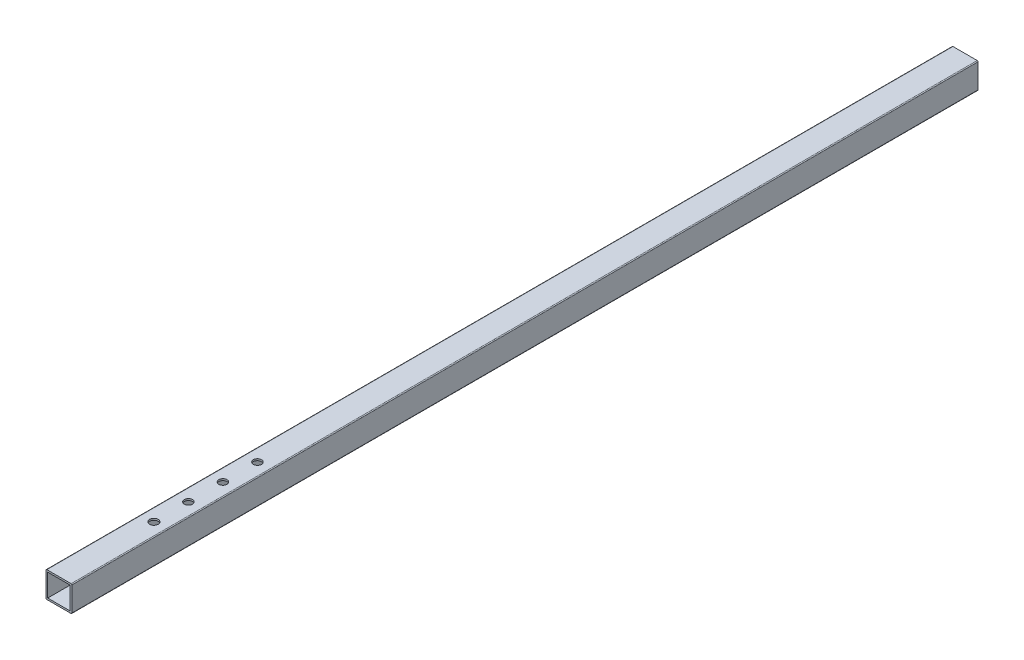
ISO-10303-21;
HEADER;
FILE_DESCRIPTION(('STEP AP214'),'2;1');
FILE_NAME('part.step','',(''),(''),'','','');
FILE_SCHEMA(('AUTOMOTIVE_DESIGN { 1 0 10303 214 1 1 1 1 }'));
ENDSEC;
DATA;
#1=APPLICATION_CONTEXT('core data for automotive mechanical design processes');
#2=APPLICATION_PROTOCOL_DEFINITION('international standard','automotive_design',2000,#1);
#3=PRODUCT_CONTEXT('',#1,'mechanical');
#4=PRODUCT('Part','Part','',(#3));
#5=PRODUCT_RELATED_PRODUCT_CATEGORY('part','',(#4));
#6=PRODUCT_DEFINITION_FORMATION('','',#4);
#7=PRODUCT_DEFINITION_CONTEXT('part definition',#1,'design');
#8=PRODUCT_DEFINITION('design','',#6,#7);
#9=PRODUCT_DEFINITION_SHAPE('','',#8);
#10=(LENGTH_UNIT() NAMED_UNIT(*) SI_UNIT(.MILLI.,.METRE.));
#11=(NAMED_UNIT(*) PLANE_ANGLE_UNIT() SI_UNIT($,.RADIAN.));
#12=(NAMED_UNIT(*) SI_UNIT($,.STERADIAN.) SOLID_ANGLE_UNIT());
#13=UNCERTAINTY_MEASURE_WITH_UNIT(LENGTH_MEASURE(1.E-05),#10,'distance_accuracy_value','');
#14=(GEOMETRIC_REPRESENTATION_CONTEXT(3) GLOBAL_UNCERTAINTY_ASSIGNED_CONTEXT((#13)) GLOBAL_UNIT_ASSIGNED_CONTEXT((#10,
#11,#12)) REPRESENTATION_CONTEXT('',''));
#15=CARTESIAN_POINT('',(0.,0.,0.));
#16=DIRECTION('',(0.,0.,1.));
#17=DIRECTION('',(1.,0.,0.));
#18=AXIS2_PLACEMENT_3D('',#15,#16,#17);
#19=CARTESIAN_POINT('',(-14.,15.,1050.));
#20=DIRECTION('',(0.,1.,0.));
#21=DIRECTION('',(0.,0.,1.));
#22=AXIS2_PLACEMENT_3D('',#19,#20,#21);
#23=PLANE('',#22);
#24=CARTESIAN_POINT('',(0.,15.,860.));
#25=DIRECTION('',(0.,-1.,0.));
#26=DIRECTION('',(0.,0.,-1.));
#27=AXIS2_PLACEMENT_3D('',#24,#25,#26);
#28=CIRCLE('',#27,4.74999999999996);
#29=CARTESIAN_POINT('',(0.,15.,855.25));
#30=VERTEX_POINT('',#29);
#31=EDGE_CURVE('E230',#30,#30,#28,.T.);
#32=ORIENTED_EDGE('',*,*,#31,.T.);
#33=EDGE_LOOP('',(#32));
#34=FACE_BOUND('',#33,.T.);
#35=CARTESIAN_POINT('',(0.,15.,940.));
#36=DIRECTION('',(0.,1.,0.));
#37=DIRECTION('',(0.,0.,1.));
#38=AXIS2_PLACEMENT_3D('',#35,#36,#37);
#39=CIRCLE('',#38,5.00000000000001);
#40=CARTESIAN_POINT('',(0.,15.,945.));
#41=VERTEX_POINT('',#40);
#42=EDGE_CURVE('E245',#41,#41,#39,.T.);
#43=ORIENTED_EDGE('',*,*,#42,.F.);
#44=EDGE_LOOP('',(#43));
#45=FACE_BOUND('',#44,.T.);
#46=CARTESIAN_POINT('',(0.,15.,820.));
#47=DIRECTION('',(0.,1.,0.));
#48=DIRECTION('',(0.,0.,1.));
#49=AXIS2_PLACEMENT_3D('',#46,#47,#48);
#50=CIRCLE('',#49,4.74999999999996);
#51=CARTESIAN_POINT('',(0.,15.,824.75));
#52=VERTEX_POINT('',#51);
#53=EDGE_CURVE('E142',#52,#52,#50,.T.);
#54=ORIENTED_EDGE('',*,*,#53,.F.);
#55=EDGE_LOOP('',(#54));
#56=FACE_BOUND('',#55,.T.);
#57=DIRECTION('',(1.,0.,0.));
#58=VECTOR('',#57,1.);
#59=CARTESIAN_POINT('',(-14.,15.,0.));
#60=LINE('',#59,#58);
#61=CARTESIAN_POINT('',(-14.,15.,0.));
#62=VERTEX_POINT('',#61);
#63=CARTESIAN_POINT('',(14.,15.,0.));
#64=VERTEX_POINT('',#63);
#65=EDGE_CURVE('E171',#62,#64,#60,.T.);
#66=ORIENTED_EDGE('',*,*,#65,.F.);
#67=DIRECTION('',(0.,0.,-1.));
#68=VECTOR('',#67,1.);
#69=CARTESIAN_POINT('',(-14.,15.,1050.));
#70=LINE('',#69,#68);
#71=CARTESIAN_POINT('',(-14.,15.,1050.));
#72=VERTEX_POINT('',#71);
#73=EDGE_CURVE('E215',#72,#62,#70,.T.);
#74=ORIENTED_EDGE('',*,*,#73,.F.);
#75=DIRECTION('',(1.,0.,0.));
#76=VECTOR('',#75,1.);
#77=CARTESIAN_POINT('',(-14.,15.,1050.));
#78=LINE('',#77,#76);
#79=CARTESIAN_POINT('',(14.,15.,1050.));
#80=VERTEX_POINT('',#79);
#81=EDGE_CURVE('E193',#72,#80,#78,.T.);
#82=ORIENTED_EDGE('',*,*,#81,.T.);
#83=DIRECTION('',(0.,0.,-1.));
#84=VECTOR('',#83,1.);
#85=CARTESIAN_POINT('',(14.,15.,1050.));
#86=LINE('',#85,#84);
#87=EDGE_CURVE('E213',#80,#64,#86,.T.);
#88=ORIENTED_EDGE('',*,*,#87,.T.);
#89=EDGE_LOOP('',(#66,#74,#82,#88));
#90=FACE_BOUND('',#89,.T.);
#91=CARTESIAN_POINT('',(0.,15.,900.));
#92=DIRECTION('',(0.,-1.,0.));
#93=DIRECTION('',(0.,0.,-1.));
#94=AXIS2_PLACEMENT_3D('',#91,#92,#93);
#95=CIRCLE('',#94,4.74999999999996);
#96=CARTESIAN_POINT('',(0.,15.,895.25));
#97=VERTEX_POINT('',#96);
#98=EDGE_CURVE('E240',#97,#97,#95,.T.);
#99=ORIENTED_EDGE('',*,*,#98,.T.);
#100=EDGE_LOOP('',(#99));
#101=FACE_BOUND('',#100,.T.);
#102=ADVANCED_FACE('F30',(#34,#45,#56,#90,#101),#23,.T.);
#103=CARTESIAN_POINT('',(-14.,13.,1050.));
#104=DIRECTION('',(0.,1.,0.));
#105=DIRECTION('',(0.,0.,1.));
#106=AXIS2_PLACEMENT_3D('',#103,#104,#105);
#107=PLANE('',#106);
#108=CARTESIAN_POINT('',(0.,13.,860.));
#109=DIRECTION('',(0.,1.,0.));
#110=DIRECTION('',(0.,0.,1.));
#111=AXIS2_PLACEMENT_3D('',#108,#109,#110);
#112=CIRCLE('',#111,4.74999999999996);
#113=CARTESIAN_POINT('',(0.,13.,864.75));
#114=VERTEX_POINT('',#113);
#115=EDGE_CURVE('E228',#114,#114,#112,.F.);
#116=ORIENTED_EDGE('',*,*,#115,.F.);
#117=EDGE_LOOP('',(#116));
#118=FACE_BOUND('',#117,.T.);
#119=CARTESIAN_POINT('',(0.,13.,940.));
#120=DIRECTION('',(0.,1.,0.));
#121=DIRECTION('',(0.,0.,1.));
#122=AXIS2_PLACEMENT_3D('',#119,#120,#121);
#123=CIRCLE('',#122,5.00000000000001);
#124=CARTESIAN_POINT('',(0.,13.,945.));
#125=VERTEX_POINT('',#124);
#126=EDGE_CURVE('E224',#125,#125,#123,.T.);
#127=ORIENTED_EDGE('',*,*,#126,.T.);
#128=EDGE_LOOP('',(#127));
#129=FACE_BOUND('',#128,.T.);
#130=CARTESIAN_POINT('',(0.,13.,820.));
#131=DIRECTION('',(0.,1.,0.));
#132=DIRECTION('',(0.,0.,1.));
#133=AXIS2_PLACEMENT_3D('',#130,#131,#132);
#134=CIRCLE('',#133,4.74999999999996);
#135=CARTESIAN_POINT('',(0.,13.,824.75));
#136=VERTEX_POINT('',#135);
#137=EDGE_CURVE('E220',#136,#136,#134,.T.);
#138=ORIENTED_EDGE('',*,*,#137,.T.);
#139=EDGE_LOOP('',(#138));
#140=FACE_BOUND('',#139,.T.);
#141=DIRECTION('',(1.,0.,0.));
#142=VECTOR('',#141,1.);
#143=CARTESIAN_POINT('',(-14.,13.,0.));
#144=LINE('',#143,#142);
#145=CARTESIAN_POINT('',(-13.,13.,0.));
#146=VERTEX_POINT('',#145);
#147=CARTESIAN_POINT('',(13.,13.,0.));
#148=VERTEX_POINT('',#147);
#149=EDGE_CURVE('E52',#146,#148,#144,.T.);
#150=ORIENTED_EDGE('',*,*,#149,.T.);
#151=DIRECTION('',(0.,0.,-1.));
#152=VECTOR('',#151,1.);
#153=CARTESIAN_POINT('',(13.,13.,1050.));
#154=LINE('',#153,#152);
#155=CARTESIAN_POINT('',(13.,13.,1050.));
#156=VERTEX_POINT('',#155);
#157=EDGE_CURVE('E47',#156,#148,#154,.T.);
#158=ORIENTED_EDGE('',*,*,#157,.F.);
#159=DIRECTION('',(1.,0.,0.));
#160=VECTOR('',#159,1.);
#161=CARTESIAN_POINT('',(-14.,13.,1050.));
#162=LINE('',#161,#160);
#163=CARTESIAN_POINT('',(-13.,13.,1050.));
#164=VERTEX_POINT('',#163);
#165=EDGE_CURVE('E156',#164,#156,#162,.T.);
#166=ORIENTED_EDGE('',*,*,#165,.F.);
#167=DIRECTION('',(0.,0.,-1.));
#168=VECTOR('',#167,1.);
#169=CARTESIAN_POINT('',(-13.,13.,1050.));
#170=LINE('',#169,#168);
#171=EDGE_CURVE('E159',#164,#146,#170,.T.);
#172=ORIENTED_EDGE('',*,*,#171,.T.);
#173=EDGE_LOOP('',(#150,#158,#166,#172));
#174=FACE_BOUND('',#173,.T.);
#175=CARTESIAN_POINT('',(0.,13.,900.));
#176=DIRECTION('',(0.,1.,0.));
#177=DIRECTION('',(0.,0.,1.));
#178=AXIS2_PLACEMENT_3D('',#175,#176,#177);
#179=CIRCLE('',#178,4.74999999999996);
#180=CARTESIAN_POINT('',(0.,13.,904.75));
#181=VERTEX_POINT('',#180);
#182=EDGE_CURVE('E34',#181,#181,#179,.F.);
#183=ORIENTED_EDGE('',*,*,#182,.F.);
#184=EDGE_LOOP('',(#183));
#185=FACE_BOUND('',#184,.T.);
#186=ADVANCED_FACE('F270',(#118,#129,#140,#174,#185),#107,.F.);
#187=CARTESIAN_POINT('',(-14.,-14.,1050.));
#188=DIRECTION('',(0.,0.,-1.));
#189=DIRECTION('',(-1.,0.,0.));
#190=AXIS2_PLACEMENT_3D('',#187,#188,#189);
#191=CYLINDRICAL_SURFACE('',#190,0.999999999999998);
#192=CARTESIAN_POINT('',(-14.,-14.,0.));
#193=DIRECTION('',(0.,0.,-1.));
#194=DIRECTION('',(-1.,0.,0.));
#195=AXIS2_PLACEMENT_3D('',#192,#193,#194);
#196=CIRCLE('',#195,0.999999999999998);
#197=CARTESIAN_POINT('',(-14.,-15.,0.));
#198=VERTEX_POINT('',#197);
#199=CARTESIAN_POINT('',(-15.,-14.,0.));
#200=VERTEX_POINT('',#199);
#201=EDGE_CURVE('E129',#198,#200,#196,.T.);
#202=ORIENTED_EDGE('',*,*,#201,.F.);
#203=DIRECTION('',(0.,0.,-1.));
#204=VECTOR('',#203,1.);
#205=CARTESIAN_POINT('',(-14.,-15.,1050.));
#206=LINE('',#205,#204);
#207=CARTESIAN_POINT('',(-14.,-15.,1050.));
#208=VERTEX_POINT('',#207);
#209=EDGE_CURVE('E11',#208,#198,#206,.T.);
#210=ORIENTED_EDGE('',*,*,#209,.F.);
#211=CARTESIAN_POINT('',(-14.,-14.,1050.));
#212=DIRECTION('',(0.,0.,-1.));
#213=DIRECTION('',(-1.,0.,0.));
#214=AXIS2_PLACEMENT_3D('',#211,#212,#213);
#215=CIRCLE('',#214,0.999999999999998);
#216=CARTESIAN_POINT('',(-15.,-14.,1050.));
#217=VERTEX_POINT('',#216);
#218=EDGE_CURVE('E185',#208,#217,#215,.T.);
#219=ORIENTED_EDGE('',*,*,#218,.T.);
#220=DIRECTION('',(0.,0.,-1.));
#221=VECTOR('',#220,1.);
#222=CARTESIAN_POINT('',(-15.,-14.,1050.));
#223=LINE('',#222,#221);
#224=EDGE_CURVE('E205',#217,#200,#223,.T.);
#225=ORIENTED_EDGE('',*,*,#224,.T.);
#226=EDGE_LOOP('',(#202,#210,#219,#225));
#227=FACE_BOUND('',#226,.T.);
#228=ADVANCED_FACE('F32',(#227),#191,.T.);
#229=CARTESIAN_POINT('',(14.,-15.,1050.));
#230=DIRECTION('',(0.,-1.,0.));
#231=DIRECTION('',(1.,0.,0.));
#232=AXIS2_PLACEMENT_3D('',#229,#230,#231);
#233=PLANE('',#232);
#234=CARTESIAN_POINT('',(0.,-15.,940.));
#235=DIRECTION('',(0.,-1.,0.));
#236=DIRECTION('',(1.,0.,0.));
#237=AXIS2_PLACEMENT_3D('',#234,#235,#236);
#238=CIRCLE('',#237,5.00000000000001);
#239=CARTESIAN_POINT('',(5.00000000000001,-15.,940.));
#240=VERTEX_POINT('',#239);
#241=EDGE_CURVE('E227',#240,#240,#238,.T.);
#242=ORIENTED_EDGE('',*,*,#241,.F.);
#243=EDGE_LOOP('',(#242));
#244=FACE_BOUND('',#243,.T.);
#245=CARTESIAN_POINT('',(0.,-15.,820.));
#246=DIRECTION('',(0.,-1.,0.));
#247=DIRECTION('',(1.,0.,0.));
#248=AXIS2_PLACEMENT_3D('',#245,#246,#247);
#249=CIRCLE('',#248,4.74999999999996);
#250=CARTESIAN_POINT('',(4.74999999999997,-15.,820.));
#251=VERTEX_POINT('',#250);
#252=EDGE_CURVE('E223',#251,#251,#249,.T.);
#253=ORIENTED_EDGE('',*,*,#252,.F.);
#254=EDGE_LOOP('',(#253));
#255=FACE_BOUND('',#254,.T.);
#256=DIRECTION('',(-1.,0.,0.));
#257=VECTOR('',#256,1.);
#258=CARTESIAN_POINT('',(14.,-15.,0.));
#259=LINE('',#258,#257);
#260=CARTESIAN_POINT('',(14.,-15.,0.));
#261=VERTEX_POINT('',#260);
#262=EDGE_CURVE('E182',#261,#198,#259,.T.);
#263=ORIENTED_EDGE('',*,*,#262,.F.);
#264=DIRECTION('',(0.,0.,-1.));
#265=VECTOR('',#264,1.);
#266=CARTESIAN_POINT('',(14.,-15.,1050.));
#267=LINE('',#266,#265);
#268=CARTESIAN_POINT('',(14.,-15.,1050.));
#269=VERTEX_POINT('',#268);
#270=EDGE_CURVE('E39',#269,#261,#267,.T.);
#271=ORIENTED_EDGE('',*,*,#270,.F.);
#272=DIRECTION('',(-1.,0.,0.));
#273=VECTOR('',#272,1.);
#274=CARTESIAN_POINT('',(14.,-15.,1050.));
#275=LINE('',#274,#273);
#276=EDGE_CURVE('E203',#269,#208,#275,.T.);
#277=ORIENTED_EDGE('',*,*,#276,.T.);
#278=ORIENTED_EDGE('',*,*,#209,.T.);
#279=EDGE_LOOP('',(#263,#271,#277,#278));
#280=FACE_BOUND('',#279,.T.);
#281=ADVANCED_FACE('F306',(#244,#255,#280),#233,.T.);
#282=CARTESIAN_POINT('',(14.,-14.,1050.));
#283=DIRECTION('',(0.,0.,-1.));
#284=DIRECTION('',(-1.,0.,0.));
#285=AXIS2_PLACEMENT_3D('',#282,#283,#284);
#286=CYLINDRICAL_SURFACE('',#285,1.);
#287=CARTESIAN_POINT('',(14.,-14.,0.));
#288=DIRECTION('',(0.,0.,-1.));
#289=DIRECTION('',(-1.,0.,0.));
#290=AXIS2_PLACEMENT_3D('',#287,#288,#289);
#291=CIRCLE('',#290,1.);
#292=CARTESIAN_POINT('',(15.,-14.,0.));
#293=VERTEX_POINT('',#292);
#294=EDGE_CURVE('E179',#293,#261,#291,.T.);
#295=ORIENTED_EDGE('',*,*,#294,.F.);
#296=DIRECTION('',(0.,0.,-1.));
#297=VECTOR('',#296,1.);
#298=CARTESIAN_POINT('',(15.,-14.,1050.));
#299=LINE('',#298,#297);
#300=CARTESIAN_POINT('',(15.,-14.,1050.));
#301=VERTEX_POINT('',#300);
#302=EDGE_CURVE('E208',#301,#293,#299,.T.);
#303=ORIENTED_EDGE('',*,*,#302,.F.);
#304=CARTESIAN_POINT('',(14.,-14.,1050.));
#305=DIRECTION('',(0.,0.,-1.));
#306=DIRECTION('',(-1.,0.,0.));
#307=AXIS2_PLACEMENT_3D('',#304,#305,#306);
#308=CIRCLE('',#307,1.);
#309=EDGE_CURVE('E200',#301,#269,#308,.T.);
#310=ORIENTED_EDGE('',*,*,#309,.T.);
#311=ORIENTED_EDGE('',*,*,#270,.T.);
#312=EDGE_LOOP('',(#295,#303,#310,#311));
#313=FACE_BOUND('',#312,.T.);
#314=ADVANCED_FACE('F309',(#313),#286,.T.);
#315=CARTESIAN_POINT('',(15.,-14.,1050.));
#316=DIRECTION('',(-1.,0.,0.));
#317=DIRECTION('',(0.,-1.,0.));
#318=AXIS2_PLACEMENT_3D('',#315,#316,#317);
#319=PLANE('',#318);
#320=DIRECTION('',(0.,1.,0.));
#321=VECTOR('',#320,1.);
#322=CARTESIAN_POINT('',(15.,-14.,0.));
#323=LINE('',#322,#321);
#324=CARTESIAN_POINT('',(15.,14.,0.));
#325=VERTEX_POINT('',#324);
#326=EDGE_CURVE('E177',#293,#325,#323,.T.);
#327=ORIENTED_EDGE('',*,*,#326,.T.);
#328=DIRECTION('',(0.,0.,-1.));
#329=VECTOR('',#328,1.);
#330=CARTESIAN_POINT('',(15.,14.,1050.));
#331=LINE('',#330,#329);
#332=CARTESIAN_POINT('',(15.,14.,1050.));
#333=VERTEX_POINT('',#332);
#334=EDGE_CURVE('E210',#333,#325,#331,.T.);
#335=ORIENTED_EDGE('',*,*,#334,.F.);
#336=DIRECTION('',(0.,1.,0.));
#337=VECTOR('',#336,1.);
#338=CARTESIAN_POINT('',(15.,-14.,1050.));
#339=LINE('',#338,#337);
#340=EDGE_CURVE('E198',#301,#333,#339,.T.);
#341=ORIENTED_EDGE('',*,*,#340,.F.);
#342=ORIENTED_EDGE('',*,*,#302,.T.);
#343=EDGE_LOOP('',(#327,#335,#341,#342));
#344=FACE_BOUND('',#343,.T.);
#345=ADVANCED_FACE('F316',(#344),#319,.F.);
#346=CARTESIAN_POINT('',(14.,14.,1050.));
#347=DIRECTION('',(0.,0.,-1.));
#348=DIRECTION('',(-1.,0.,0.));
#349=AXIS2_PLACEMENT_3D('',#346,#347,#348);
#350=CYLINDRICAL_SURFACE('',#349,0.999999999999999);
#351=CARTESIAN_POINT('',(14.,14.,0.));
#352=DIRECTION('',(0.,0.,1.));
#353=DIRECTION('',(1.,0.,0.));
#354=AXIS2_PLACEMENT_3D('',#351,#352,#353);
#355=CIRCLE('',#354,0.999999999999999);
#356=EDGE_CURVE('E174',#325,#64,#355,.T.);
#357=ORIENTED_EDGE('',*,*,#356,.T.);
#358=ORIENTED_EDGE('',*,*,#87,.F.);
#359=CARTESIAN_POINT('',(14.,14.,1050.));
#360=DIRECTION('',(0.,0.,1.));
#361=DIRECTION('',(1.,0.,0.));
#362=AXIS2_PLACEMENT_3D('',#359,#360,#361);
#363=CIRCLE('',#362,0.999999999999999);
#364=EDGE_CURVE('E196',#333,#80,#363,.T.);
#365=ORIENTED_EDGE('',*,*,#364,.F.);
#366=ORIENTED_EDGE('',*,*,#334,.T.);
#367=EDGE_LOOP('',(#357,#358,#365,#366));
#368=FACE_BOUND('',#367,.T.);
#369=ADVANCED_FACE('F279',(#368),#350,.T.);
#370=CARTESIAN_POINT('',(-14.,14.,1050.));
#371=DIRECTION('',(0.,0.,-1.));
#372=DIRECTION('',(-1.,0.,0.));
#373=AXIS2_PLACEMENT_3D('',#370,#371,#372);
#374=CYLINDRICAL_SURFACE('',#373,0.999999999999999);
#375=CARTESIAN_POINT('',(-14.,14.,0.));
#376=DIRECTION('',(0.,0.,-1.));
#377=DIRECTION('',(-1.,0.,0.));
#378=AXIS2_PLACEMENT_3D('',#375,#376,#377);
#379=CIRCLE('',#378,0.999999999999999);
#380=CARTESIAN_POINT('',(-15.,14.,0.));
#381=VERTEX_POINT('',#380);
#382=EDGE_CURVE('E168',#381,#62,#379,.T.);
#383=ORIENTED_EDGE('',*,*,#382,.F.);
#384=DIRECTION('',(0.,0.,-1.));
#385=VECTOR('',#384,1.);
#386=CARTESIAN_POINT('',(-15.,14.,1050.));
#387=LINE('',#386,#385);
#388=CARTESIAN_POINT('',(-15.,14.,1050.));
#389=VERTEX_POINT('',#388);
#390=EDGE_CURVE('E217',#389,#381,#387,.T.);
#391=ORIENTED_EDGE('',*,*,#390,.F.);
#392=CARTESIAN_POINT('',(-14.,14.,1050.));
#393=DIRECTION('',(0.,0.,-1.));
#394=DIRECTION('',(-1.,0.,0.));
#395=AXIS2_PLACEMENT_3D('',#392,#393,#394);
#396=CIRCLE('',#395,0.999999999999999);
#397=EDGE_CURVE('E190',#389,#72,#396,.T.);
#398=ORIENTED_EDGE('',*,*,#397,.T.);
#399=ORIENTED_EDGE('',*,*,#73,.T.);
#400=EDGE_LOOP('',(#383,#391,#398,#399));
#401=FACE_BOUND('',#400,.T.);
#402=ADVANCED_FACE('F281',(#401),#374,.T.);
#403=CARTESIAN_POINT('',(-15.,14.,1050.));
#404=DIRECTION('',(1.,0.,0.));
#405=DIRECTION('',(0.,1.,0.));
#406=AXIS2_PLACEMENT_3D('',#403,#404,#405);
#407=PLANE('',#406);
#408=DIRECTION('',(0.,-1.,0.));
#409=VECTOR('',#408,1.);
#410=CARTESIAN_POINT('',(-15.,14.,0.));
#411=LINE('',#410,#409);
#412=EDGE_CURVE('E165',#381,#200,#411,.T.);
#413=ORIENTED_EDGE('',*,*,#412,.T.);
#414=ORIENTED_EDGE('',*,*,#224,.F.);
#415=DIRECTION('',(0.,-1.,0.));
#416=VECTOR('',#415,1.);
#417=CARTESIAN_POINT('',(-15.,14.,1050.));
#418=LINE('',#417,#416);
#419=EDGE_CURVE('E188',#389,#217,#418,.T.);
#420=ORIENTED_EDGE('',*,*,#419,.F.);
#421=ORIENTED_EDGE('',*,*,#390,.T.);
#422=EDGE_LOOP('',(#413,#414,#420,#421));
#423=FACE_BOUND('',#422,.T.);
#424=ADVANCED_FACE('F283',(#423),#407,.F.);
#425=CARTESIAN_POINT('',(-14.,-14.,1050.));
#426=DIRECTION('',(0.,0.,-1.));
#427=DIRECTION('',(-1.,0.,0.));
#428=AXIS2_PLACEMENT_3D('',#425,#426,#427);
#429=PLANE('',#428);
#430=DIRECTION('',(0.,1.,0.));
#431=VECTOR('',#430,1.);
#432=CARTESIAN_POINT('',(13.,-14.,1050.));
#433=LINE('',#432,#431);
#434=CARTESIAN_POINT('',(13.,-13.,1050.));
#435=VERTEX_POINT('',#434);
#436=EDGE_CURVE('E154',#435,#156,#433,.T.);
#437=ORIENTED_EDGE('',*,*,#436,.F.);
#438=DIRECTION('',(-1.,0.,0.));
#439=VECTOR('',#438,1.);
#440=CARTESIAN_POINT('',(-14.,-13.,1050.));
#441=LINE('',#440,#439);
#442=CARTESIAN_POINT('',(-13.,-13.,1050.));
#443=VERTEX_POINT('',#442);
#444=EDGE_CURVE('E152',#435,#443,#441,.T.);
#445=ORIENTED_EDGE('',*,*,#444,.T.);
#446=DIRECTION('',(0.,-1.,0.));
#447=VECTOR('',#446,1.);
#448=CARTESIAN_POINT('',(-13.,-14.,1050.));
#449=LINE('',#448,#447);
#450=EDGE_CURVE('E125',#164,#443,#449,.T.);
#451=ORIENTED_EDGE('',*,*,#450,.F.);
#452=ORIENTED_EDGE('',*,*,#165,.T.);
#453=EDGE_LOOP('',(#437,#445,#451,#452));
#454=FACE_BOUND('',#453,.T.);
#455=ORIENTED_EDGE('',*,*,#218,.F.);
#456=ORIENTED_EDGE('',*,*,#276,.F.);
#457=ORIENTED_EDGE('',*,*,#309,.F.);
#458=ORIENTED_EDGE('',*,*,#340,.T.);
#459=ORIENTED_EDGE('',*,*,#364,.T.);
#460=ORIENTED_EDGE('',*,*,#81,.F.);
#461=ORIENTED_EDGE('',*,*,#397,.F.);
#462=ORIENTED_EDGE('',*,*,#419,.T.);
#463=EDGE_LOOP('',(#455,#456,#457,#458,#459,#460,#461,#462));
#464=FACE_BOUND('',#463,.T.);
#465=ADVANCED_FACE('F286',(#454,#464),#429,.F.);
#466=CARTESIAN_POINT('',(-14.,-14.,0.));
#467=DIRECTION('',(0.,0.,-1.));
#468=DIRECTION('',(-1.,0.,0.));
#469=AXIS2_PLACEMENT_3D('',#466,#467,#468);
#470=PLANE('',#469);
#471=DIRECTION('',(-1.,0.,0.));
#472=VECTOR('',#471,1.);
#473=CARTESIAN_POINT('',(-14.,-13.,0.));
#474=LINE('',#473,#472);
#475=CARTESIAN_POINT('',(13.,-13.,0.));
#476=VERTEX_POINT('',#475);
#477=CARTESIAN_POINT('',(-13.,-13.,0.));
#478=VERTEX_POINT('',#477);
#479=EDGE_CURVE('E133',#476,#478,#474,.T.);
#480=ORIENTED_EDGE('',*,*,#479,.F.);
#481=DIRECTION('',(0.,1.,0.));
#482=VECTOR('',#481,1.);
#483=CARTESIAN_POINT('',(13.,-14.,0.));
#484=LINE('',#483,#482);
#485=EDGE_CURVE('E138',#476,#148,#484,.T.);
#486=ORIENTED_EDGE('',*,*,#485,.T.);
#487=ORIENTED_EDGE('',*,*,#149,.F.);
#488=DIRECTION('',(0.,-1.,0.));
#489=VECTOR('',#488,1.);
#490=CARTESIAN_POINT('',(-13.,-14.,0.));
#491=LINE('',#490,#489);
#492=EDGE_CURVE('E123',#146,#478,#491,.T.);
#493=ORIENTED_EDGE('',*,*,#492,.T.);
#494=EDGE_LOOP('',(#480,#486,#487,#493));
#495=FACE_BOUND('',#494,.T.);
#496=ORIENTED_EDGE('',*,*,#201,.T.);
#497=ORIENTED_EDGE('',*,*,#412,.F.);
#498=ORIENTED_EDGE('',*,*,#382,.T.);
#499=ORIENTED_EDGE('',*,*,#65,.T.);
#500=ORIENTED_EDGE('',*,*,#356,.F.);
#501=ORIENTED_EDGE('',*,*,#326,.F.);
#502=ORIENTED_EDGE('',*,*,#294,.T.);
#503=ORIENTED_EDGE('',*,*,#262,.T.);
#504=EDGE_LOOP('',(#496,#497,#498,#499,#500,#501,#502,#503));
#505=FACE_BOUND('',#504,.T.);
#506=ADVANCED_FACE('F140',(#495,#505),#470,.T.);
#507=CARTESIAN_POINT('',(-13.,-14.,1050.));
#508=DIRECTION('',(1.,0.,0.));
#509=DIRECTION('',(0.,1.,0.));
#510=AXIS2_PLACEMENT_3D('',#507,#508,#509);
#511=PLANE('',#510);
#512=ORIENTED_EDGE('',*,*,#492,.F.);
#513=ORIENTED_EDGE('',*,*,#171,.F.);
#514=ORIENTED_EDGE('',*,*,#450,.T.);
#515=DIRECTION('',(0.,0.,-1.));
#516=VECTOR('',#515,1.);
#517=CARTESIAN_POINT('',(-13.,-13.,1050.));
#518=LINE('',#517,#516);
#519=EDGE_CURVE('E119',#443,#478,#518,.T.);
#520=ORIENTED_EDGE('',*,*,#519,.T.);
#521=EDGE_LOOP('',(#512,#513,#514,#520));
#522=FACE_BOUND('',#521,.T.);
#523=ADVANCED_FACE('F121',(#522),#511,.T.);
#524=CARTESIAN_POINT('',(-14.,-13.,1050.));
#525=DIRECTION('',(0.,-1.,0.));
#526=DIRECTION('',(1.,0.,0.));
#527=AXIS2_PLACEMENT_3D('',#524,#525,#526);
#528=PLANE('',#527);
#529=CARTESIAN_POINT('',(0.,-13.,940.));
#530=DIRECTION('',(0.,-1.,0.));
#531=DIRECTION('',(1.,0.,0.));
#532=AXIS2_PLACEMENT_3D('',#529,#530,#531);
#533=CIRCLE('',#532,5.00000000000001);
#534=CARTESIAN_POINT('',(5.00000000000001,-13.,940.));
#535=VERTEX_POINT('',#534);
#536=EDGE_CURVE('E226',#535,#535,#533,.T.);
#537=ORIENTED_EDGE('',*,*,#536,.T.);
#538=EDGE_LOOP('',(#537));
#539=FACE_BOUND('',#538,.T.);
#540=CARTESIAN_POINT('',(0.,-13.,820.));
#541=DIRECTION('',(0.,-1.,0.));
#542=DIRECTION('',(1.,0.,0.));
#543=AXIS2_PLACEMENT_3D('',#540,#541,#542);
#544=CIRCLE('',#543,4.74999999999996);
#545=CARTESIAN_POINT('',(4.74999999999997,-13.,820.));
#546=VERTEX_POINT('',#545);
#547=EDGE_CURVE('E145',#546,#546,#544,.T.);
#548=ORIENTED_EDGE('',*,*,#547,.T.);
#549=EDGE_LOOP('',(#548));
#550=FACE_BOUND('',#549,.T.);
#551=ORIENTED_EDGE('',*,*,#479,.T.);
#552=ORIENTED_EDGE('',*,*,#519,.F.);
#553=ORIENTED_EDGE('',*,*,#444,.F.);
#554=DIRECTION('',(0.,0.,-1.));
#555=VECTOR('',#554,1.);
#556=CARTESIAN_POINT('',(13.,-13.,1050.));
#557=LINE('',#556,#555);
#558=EDGE_CURVE('E130',#435,#476,#557,.T.);
#559=ORIENTED_EDGE('',*,*,#558,.T.);
#560=EDGE_LOOP('',(#551,#552,#553,#559));
#561=FACE_BOUND('',#560,.T.);
#562=ADVANCED_FACE('F134',(#539,#550,#561),#528,.F.);
#563=CARTESIAN_POINT('',(13.,-14.,1050.));
#564=DIRECTION('',(-1.,0.,0.));
#565=DIRECTION('',(0.,-1.,0.));
#566=AXIS2_PLACEMENT_3D('',#563,#564,#565);
#567=PLANE('',#566);
#568=ORIENTED_EDGE('',*,*,#485,.F.);
#569=ORIENTED_EDGE('',*,*,#558,.F.);
#570=ORIENTED_EDGE('',*,*,#436,.T.);
#571=ORIENTED_EDGE('',*,*,#157,.T.);
#572=EDGE_LOOP('',(#568,#569,#570,#571));
#573=FACE_BOUND('',#572,.T.);
#574=ADVANCED_FACE('F266',(#573),#567,.T.);
#575=CARTESIAN_POINT('',(0.,20.,820.));
#576=DIRECTION('',(0.,-1.,0.));
#577=DIRECTION('',(1.,0.,0.));
#578=AXIS2_PLACEMENT_3D('',#575,#576,#577);
#579=CYLINDRICAL_SURFACE('',#578,4.74999999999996);
#580=ORIENTED_EDGE('',*,*,#53,.T.);
#581=EDGE_LOOP('',(#580));
#582=FACE_BOUND('',#581,.T.);
#583=ORIENTED_EDGE('',*,*,#137,.F.);
#584=EDGE_LOOP('',(#583));
#585=FACE_BOUND('',#584,.T.);
#586=ADVANCED_FACE('F256',(#582,#585),#579,.F.);
#587=ORIENTED_EDGE('',*,*,#252,.T.);
#588=EDGE_LOOP('',(#587));
#589=FACE_BOUND('',#588,.T.);
#590=ORIENTED_EDGE('',*,*,#547,.F.);
#591=EDGE_LOOP('',(#590));
#592=FACE_BOUND('',#591,.T.);
#593=ADVANCED_FACE('F253',(#589,#592),#579,.F.);
#594=CARTESIAN_POINT('',(0.,20.,940.));
#595=DIRECTION('',(0.,-1.,0.));
#596=DIRECTION('',(1.,0.,0.));
#597=AXIS2_PLACEMENT_3D('',#594,#595,#596);
#598=CYLINDRICAL_SURFACE('',#597,5.00000000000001);
#599=ORIENTED_EDGE('',*,*,#42,.T.);
#600=EDGE_LOOP('',(#599));
#601=FACE_BOUND('',#600,.T.);
#602=ORIENTED_EDGE('',*,*,#126,.F.);
#603=EDGE_LOOP('',(#602));
#604=FACE_BOUND('',#603,.T.);
#605=ADVANCED_FACE('F255',(#601,#604),#598,.F.);
#606=ORIENTED_EDGE('',*,*,#241,.T.);
#607=EDGE_LOOP('',(#606));
#608=FACE_BOUND('',#607,.T.);
#609=ORIENTED_EDGE('',*,*,#536,.F.);
#610=EDGE_LOOP('',(#609));
#611=FACE_BOUND('',#610,.T.);
#612=ADVANCED_FACE('F263',(#608,#611),#598,.F.);
#613=CARTESIAN_POINT('',(0.,5.,860.));
#614=DIRECTION('',(0.,1.,0.));
#615=DIRECTION('',(0.,0.,1.));
#616=AXIS2_PLACEMENT_3D('',#613,#614,#615);
#617=CYLINDRICAL_SURFACE('',#616,4.74999999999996);
#618=ORIENTED_EDGE('',*,*,#31,.F.);
#619=EDGE_LOOP('',(#618));
#620=FACE_BOUND('',#619,.T.);
#621=ORIENTED_EDGE('',*,*,#115,.T.);
#622=EDGE_LOOP('',(#621));
#623=FACE_BOUND('',#622,.T.);
#624=ADVANCED_FACE('F329',(#620,#623),#617,.F.);
#625=CARTESIAN_POINT('',(0.,5.,900.));
#626=DIRECTION('',(0.,1.,0.));
#627=DIRECTION('',(0.,0.,1.));
#628=AXIS2_PLACEMENT_3D('',#625,#626,#627);
#629=CYLINDRICAL_SURFACE('',#628,4.74999999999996);
#630=ORIENTED_EDGE('',*,*,#98,.F.);
#631=EDGE_LOOP('',(#630));
#632=FACE_BOUND('',#631,.T.);
#633=ORIENTED_EDGE('',*,*,#182,.T.);
#634=EDGE_LOOP('',(#633));
#635=FACE_BOUND('',#634,.T.);
#636=ADVANCED_FACE('F326',(#632,#635),#629,.F.);
#637=CLOSED_SHELL('',(#102,#186,#228,#281,#314,#345,#369,#402,#424,#465,#506,#523,#562,#574,
#586,#593,#605,#612,#624,#636));
#638=MANIFOLD_SOLID_BREP('B2',#637);
#639=ADVANCED_BREP_SHAPE_REPRESENTATION('',(#18,#638),#14);
#640=SHAPE_DEFINITION_REPRESENTATION(#9,#639);
ENDSEC;
END-ISO-10303-21;
